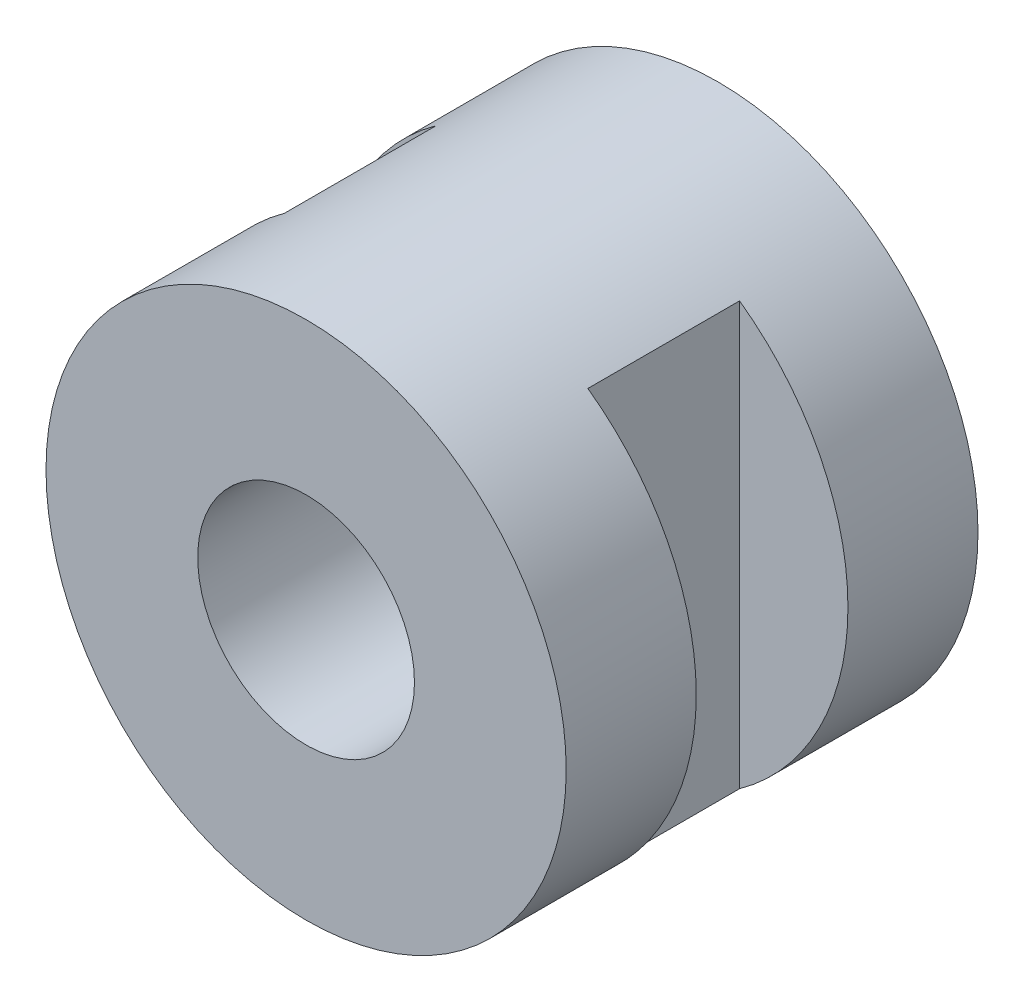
from build123d import *

# Parameters (mm, degrees)
SKETCH_1_R               = 6
EXTRUDE_1_DEPTH          = 9.5
SKETCH_2_R               = 2.5
CUT_EXTRUDE_1_DEPTH      = 9.5
CUT_EXTRUDE_2_DEPTH      = 13.737739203
CUT_EXTRUDE_2_DEPTH_BACK = 13.737739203
SKETCH_3_W               = 2.720555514
SKETCH_3_H               = 3.5


with BuildPart() as part:
    # Sketch 1 → Extrude 1 (new body)
    with BuildSketch(Plane.XY):
        Circle(SKETCH_1_R)
    extrude(amount=EXTRUDE_1_DEPTH)

    # Sketch 2 → Cut-Extrude 1 (cut)
    with BuildSketch(Plane.XY.offset(9.5)):
        Circle(SKETCH_2_R)
    extrude(amount=-CUT_EXTRUDE_1_DEPTH, mode=Mode.SUBTRACT)

    # Sketch 3 → Cut-Extrude 2 (cut, two sides: drawn at the far end of the back side and taken through both)
    with BuildSketch(Plane(origin=(0, 0, 0), x_dir=(-1, 0, 0), z_dir=(0, 1, 0)).offset(-CUT_EXTRUDE_2_DEPTH_BACK)):
        with Locations((-4.860277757, 4.75)):
            Rectangle(SKETCH_3_W, SKETCH_3_H)
        with Locations((4.860277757, 4.75)):
            Rectangle(SKETCH_3_W, SKETCH_3_H)
    extrude(amount=CUT_EXTRUDE_2_DEPTH + CUT_EXTRUDE_2_DEPTH_BACK, mode=Mode.SUBTRACT)


solid = part.part
